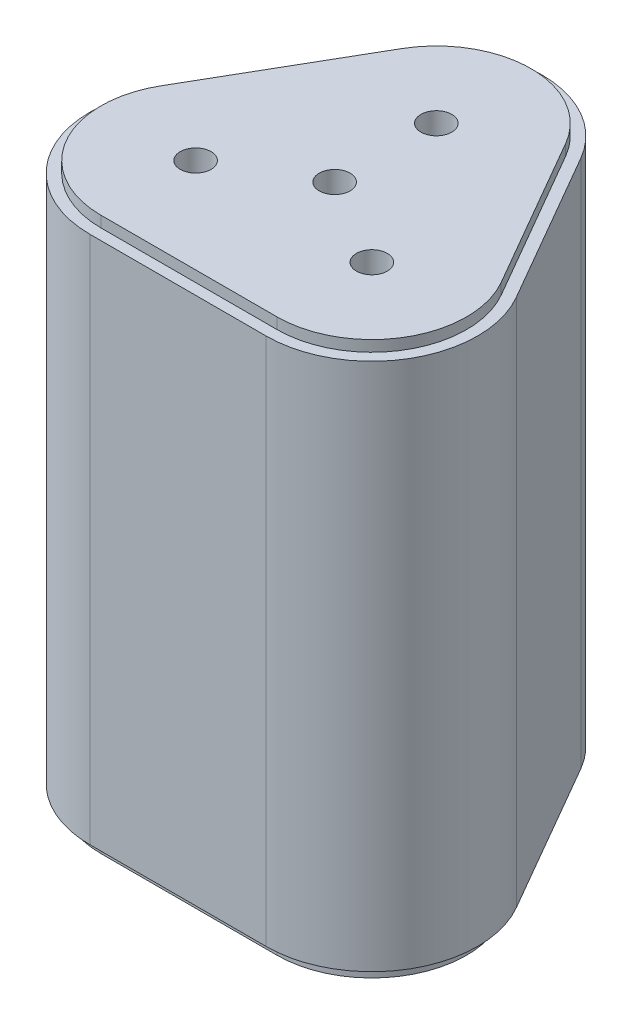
ISO-10303-21;
HEADER;
FILE_DESCRIPTION(('STEP AP214'),'2;1');
FILE_NAME('part.step','',(''),(''),'','','');
FILE_SCHEMA(('AUTOMOTIVE_DESIGN { 1 0 10303 214 1 1 1 1 }'));
ENDSEC;
DATA;
#1=APPLICATION_CONTEXT('core data for automotive mechanical design processes');
#2=APPLICATION_PROTOCOL_DEFINITION('international standard','automotive_design',2000,#1);
#3=PRODUCT_CONTEXT('',#1,'mechanical');
#4=PRODUCT('Part','Part','',(#3));
#5=PRODUCT_RELATED_PRODUCT_CATEGORY('part','',(#4));
#6=PRODUCT_DEFINITION_FORMATION('','',#4);
#7=PRODUCT_DEFINITION_CONTEXT('part definition',#1,'design');
#8=PRODUCT_DEFINITION('design','',#6,#7);
#9=PRODUCT_DEFINITION_SHAPE('','',#8);
#10=(LENGTH_UNIT() NAMED_UNIT(*) SI_UNIT(.MILLI.,.METRE.));
#11=(NAMED_UNIT(*) PLANE_ANGLE_UNIT() SI_UNIT($,.RADIAN.));
#12=(NAMED_UNIT(*) SI_UNIT($,.STERADIAN.) SOLID_ANGLE_UNIT());
#13=UNCERTAINTY_MEASURE_WITH_UNIT(LENGTH_MEASURE(1.E-05),#10,'distance_accuracy_value','');
#14=(GEOMETRIC_REPRESENTATION_CONTEXT(3) GLOBAL_UNCERTAINTY_ASSIGNED_CONTEXT((#13)) GLOBAL_UNIT_ASSIGNED_CONTEXT((#10,
#11,#12)) REPRESENTATION_CONTEXT('',''));
#15=CARTESIAN_POINT('',(0.,0.,0.));
#16=DIRECTION('',(0.,0.,1.));
#17=DIRECTION('',(1.,0.,0.));
#18=AXIS2_PLACEMENT_3D('',#15,#16,#17);
#19=CARTESIAN_POINT('',(0.,60.,-11.5470053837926));
#20=DIRECTION('',(0.,-1.,0.));
#21=DIRECTION('',(0.,0.,-1.));
#22=AXIS2_PLACEMENT_3D('',#19,#20,#21);
#23=PLANE('',#22);
#24=CARTESIAN_POINT('',(0.,60.,-11.5470053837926));
#25=DIRECTION('',(0.,1.,0.));
#26=DIRECTION('',(0.,0.,-1.));
#27=AXIS2_PLACEMENT_3D('',#24,#25,#26);
#28=CIRCLE('',#27,12.);
#29=CARTESIAN_POINT('',(10.3923048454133,60.,-17.5470053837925));
#30=VERTEX_POINT('',#29);
#31=CARTESIAN_POINT('',(-10.3923048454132,60.,-17.5470053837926));
#32=VERTEX_POINT('',#31);
#33=EDGE_CURVE('E310',#30,#32,#28,.T.);
#34=ORIENTED_EDGE('',*,*,#33,.T.);
#35=DIRECTION('',(-0.500000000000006,0.,0.866025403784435));
#36=VECTOR('',#35,1.);
#37=CARTESIAN_POINT('',(-10.3923048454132,60.,-17.5470053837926));
#38=LINE('',#37,#36);
#39=CARTESIAN_POINT('',(-20.3923048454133,60.,-0.226497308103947));
#40=VERTEX_POINT('',#39);
#41=EDGE_CURVE('E313',#32,#40,#38,.T.);
#42=ORIENTED_EDGE('',*,*,#41,.T.);
#43=CARTESIAN_POINT('',(-10.0000000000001,60.,5.77350269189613));
#44=DIRECTION('',(0.,1.,0.));
#45=DIRECTION('',(0.,0.,1.));
#46=AXIS2_PLACEMENT_3D('',#43,#44,#45);
#47=CIRCLE('',#46,12.);
#48=CARTESIAN_POINT('',(-10.0000000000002,60.,17.7735026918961));
#49=VERTEX_POINT('',#48);
#50=EDGE_CURVE('E316',#40,#49,#47,.T.);
#51=ORIENTED_EDGE('',*,*,#50,.T.);
#52=DIRECTION('',(1.,0.,0.));
#53=VECTOR('',#52,1.);
#54=CARTESIAN_POINT('',(9.99999999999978,60.,17.7735026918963));
#55=LINE('',#54,#53);
#56=CARTESIAN_POINT('',(9.99999999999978,60.,17.7735026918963));
#57=VERTEX_POINT('',#56);
#58=EDGE_CURVE('E318',#49,#57,#55,.T.);
#59=ORIENTED_EDGE('',*,*,#58,.T.);
#60=CARTESIAN_POINT('',(9.99999999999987,60.,5.77350269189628));
#61=DIRECTION('',(0.,1.,0.));
#62=DIRECTION('',(0.,0.,-1.));
#63=AXIS2_PLACEMENT_3D('',#60,#61,#62);
#64=CIRCLE('',#63,12.);
#65=CARTESIAN_POINT('',(20.3923048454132,60.,-0.226497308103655));
#66=VERTEX_POINT('',#65);
#67=EDGE_CURVE('E320',#57,#66,#64,.T.);
#68=ORIENTED_EDGE('',*,*,#67,.T.);
#69=DIRECTION('',(-0.499999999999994,0.,-0.866025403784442));
#70=VECTOR('',#69,1.);
#71=CARTESIAN_POINT('',(10.3923048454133,60.,-17.5470053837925));
#72=LINE('',#71,#70);
#73=EDGE_CURVE('E322',#66,#30,#72,.T.);
#74=ORIENTED_EDGE('',*,*,#73,.T.);
#75=EDGE_LOOP('',(#34,#42,#51,#59,#68,#74));
#76=FACE_BOUND('',#75,.T.);
#77=CARTESIAN_POINT('',(0.,60.,-11.5470053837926));
#78=DIRECTION('',(0.,1.,0.));
#79=DIRECTION('',(0.,0.,1.));
#80=AXIS2_PLACEMENT_3D('',#77,#78,#79);
#81=CIRCLE('',#80,10.75);
#82=CARTESIAN_POINT('',(9.30977309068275,60.,-16.9220053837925));
#83=VERTEX_POINT('',#82);
#84=CARTESIAN_POINT('',(-9.30977309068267,60.,-16.9220053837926));
#85=VERTEX_POINT('',#84);
#86=EDGE_CURVE('E218',#83,#85,#81,.T.);
#87=ORIENTED_EDGE('',*,*,#86,.F.);
#88=DIRECTION('',(-0.499999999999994,0.,-0.866025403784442));
#89=VECTOR('',#88,1.);
#90=CARTESIAN_POINT('',(19.3097730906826,60.,0.398502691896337));
#91=LINE('',#90,#89);
#92=CARTESIAN_POINT('',(19.3097730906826,60.,0.39850269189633));
#93=VERTEX_POINT('',#92);
#94=EDGE_CURVE('E215',#93,#83,#91,.T.);
#95=ORIENTED_EDGE('',*,*,#94,.F.);
#96=CARTESIAN_POINT('',(9.99999999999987,60.,5.77350269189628));
#97=DIRECTION('',(0.,1.,0.));
#98=DIRECTION('',(0.,0.,1.));
#99=AXIS2_PLACEMENT_3D('',#96,#97,#98);
#100=CIRCLE('',#99,10.75);
#101=CARTESIAN_POINT('',(9.99999999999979,60.,16.5235026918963));
#102=VERTEX_POINT('',#101);
#103=EDGE_CURVE('E528',#102,#93,#100,.T.);
#104=ORIENTED_EDGE('',*,*,#103,.F.);
#105=DIRECTION('',(1.,0.,0.));
#106=VECTOR('',#105,1.);
#107=CARTESIAN_POINT('',(-10.0000000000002,60.,16.5235026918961));
#108=LINE('',#107,#106);
#109=CARTESIAN_POINT('',(-10.0000000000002,60.,16.5235026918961));
#110=VERTEX_POINT('',#109);
#111=EDGE_CURVE('E525',#110,#102,#108,.T.);
#112=ORIENTED_EDGE('',*,*,#111,.F.);
#113=CARTESIAN_POINT('',(-10.0000000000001,60.,5.77350269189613));
#114=DIRECTION('',(0.,1.,0.));
#115=DIRECTION('',(0.,0.,1.));
#116=AXIS2_PLACEMENT_3D('',#113,#114,#115);
#117=CIRCLE('',#116,10.75);
#118=CARTESIAN_POINT('',(-19.3097730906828,60.,0.398502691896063));
#119=VERTEX_POINT('',#118);
#120=EDGE_CURVE('E57',#119,#110,#117,.T.);
#121=ORIENTED_EDGE('',*,*,#120,.F.);
#122=DIRECTION('',(-0.500000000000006,0.,0.866025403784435));
#123=VECTOR('',#122,1.);
#124=CARTESIAN_POINT('',(-9.30977309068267,60.,-16.9220053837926));
#125=LINE('',#124,#123);
#126=EDGE_CURVE('E52',#85,#119,#125,.T.);
#127=ORIENTED_EDGE('',*,*,#126,.F.);
#128=EDGE_LOOP('',(#87,#95,#104,#112,#121,#127));
#129=FACE_BOUND('',#128,.T.);
#130=ADVANCED_FACE('F37',(#76,#129),#23,.F.);
#131=CARTESIAN_POINT('',(0.,0.,-11.5470053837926));
#132=DIRECTION('',(0.,-1.,0.));
#133=DIRECTION('',(0.,0.,-1.));
#134=AXIS2_PLACEMENT_3D('',#131,#132,#133);
#135=PLANE('',#134);
#136=CARTESIAN_POINT('',(0.,0.,-11.5470053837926));
#137=DIRECTION('',(0.,1.,0.));
#138=DIRECTION('',(0.,0.,-1.));
#139=AXIS2_PLACEMENT_3D('',#136,#137,#138);
#140=CIRCLE('',#139,12.);
#141=CARTESIAN_POINT('',(10.3923048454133,0.,-17.5470053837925));
#142=VERTEX_POINT('',#141);
#143=CARTESIAN_POINT('',(-10.3923048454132,0.,-17.5470053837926));
#144=VERTEX_POINT('',#143);
#145=EDGE_CURVE('E309',#142,#144,#140,.T.);
#146=ORIENTED_EDGE('',*,*,#145,.F.);
#147=DIRECTION('',(-0.499999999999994,0.,-0.866025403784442));
#148=VECTOR('',#147,1.);
#149=CARTESIAN_POINT('',(10.3923048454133,0.,-17.5470053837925));
#150=LINE('',#149,#148);
#151=CARTESIAN_POINT('',(20.3923048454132,0.,-0.226497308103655));
#152=VERTEX_POINT('',#151);
#153=EDGE_CURVE('E314',#152,#142,#150,.T.);
#154=ORIENTED_EDGE('',*,*,#153,.F.);
#155=CARTESIAN_POINT('',(9.99999999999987,0.,5.77350269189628));
#156=DIRECTION('',(0.,1.,0.));
#157=DIRECTION('',(0.,0.,-1.));
#158=AXIS2_PLACEMENT_3D('',#155,#156,#157);
#159=CIRCLE('',#158,12.);
#160=CARTESIAN_POINT('',(9.99999999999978,0.,17.7735026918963));
#161=VERTEX_POINT('',#160);
#162=EDGE_CURVE('E333',#161,#152,#159,.T.);
#163=ORIENTED_EDGE('',*,*,#162,.F.);
#164=DIRECTION('',(1.,0.,0.));
#165=VECTOR('',#164,1.);
#166=CARTESIAN_POINT('',(9.99999999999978,0.,17.7735026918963));
#167=LINE('',#166,#165);
#168=CARTESIAN_POINT('',(-10.0000000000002,0.,17.7735026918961));
#169=VERTEX_POINT('',#168);
#170=EDGE_CURVE('E331',#169,#161,#167,.T.);
#171=ORIENTED_EDGE('',*,*,#170,.F.);
#172=CARTESIAN_POINT('',(-10.0000000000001,0.,5.77350269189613));
#173=DIRECTION('',(0.,1.,0.));
#174=DIRECTION('',(0.,0.,1.));
#175=AXIS2_PLACEMENT_3D('',#172,#173,#174);
#176=CIRCLE('',#175,12.);
#177=CARTESIAN_POINT('',(-20.3923048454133,0.,-0.226497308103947));
#178=VERTEX_POINT('',#177);
#179=EDGE_CURVE('E329',#178,#169,#176,.T.);
#180=ORIENTED_EDGE('',*,*,#179,.F.);
#181=DIRECTION('',(-0.500000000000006,0.,0.866025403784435));
#182=VECTOR('',#181,1.);
#183=CARTESIAN_POINT('',(-10.3923048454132,0.,-17.5470053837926));
#184=LINE('',#183,#182);
#185=EDGE_CURVE('E327',#144,#178,#184,.T.);
#186=ORIENTED_EDGE('',*,*,#185,.F.);
#187=EDGE_LOOP('',(#146,#154,#163,#171,#180,#186));
#188=FACE_BOUND('',#187,.T.);
#189=DIRECTION('',(0.499999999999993,0.,0.866025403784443));
#190=VECTOR('',#189,1.);
#191=CARTESIAN_POINT('',(9.30977309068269,0.,-16.9220053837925));
#192=LINE('',#191,#190);
#193=CARTESIAN_POINT('',(9.30977309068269,0.,-16.9220053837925));
#194=VERTEX_POINT('',#193);
#195=CARTESIAN_POINT('',(19.3097730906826,0.,0.398502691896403));
#196=VERTEX_POINT('',#195);
#197=EDGE_CURVE('E260',#194,#196,#192,.T.);
#198=ORIENTED_EDGE('',*,*,#197,.F.);
#199=CARTESIAN_POINT('',(0.,0.,-11.5470053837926));
#200=DIRECTION('',(0.,-1.,0.));
#201=DIRECTION('',(0.,0.,-1.));
#202=AXIS2_PLACEMENT_3D('',#199,#200,#201);
#203=CIRCLE('',#202,10.7499999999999);
#204=CARTESIAN_POINT('',(-9.30977309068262,0.,-16.9220053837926));
#205=VERTEX_POINT('',#204);
#206=EDGE_CURVE('E242',#205,#194,#203,.T.);
#207=ORIENTED_EDGE('',*,*,#206,.F.);
#208=DIRECTION('',(0.500000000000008,0.,-0.866025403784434));
#209=VECTOR('',#208,1.);
#210=CARTESIAN_POINT('',(-19.3097730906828,0.,0.398502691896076));
#211=LINE('',#210,#209);
#212=CARTESIAN_POINT('',(-19.3097730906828,0.,0.39850269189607));
#213=VERTEX_POINT('',#212);
#214=EDGE_CURVE('E247',#213,#205,#211,.T.);
#215=ORIENTED_EDGE('',*,*,#214,.F.);
#216=CARTESIAN_POINT('',(-10.0000000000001,0.,5.77350269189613));
#217=DIRECTION('',(0.,-1.,0.));
#218=DIRECTION('',(0.,0.,-1.));
#219=AXIS2_PLACEMENT_3D('',#216,#217,#218);
#220=CIRCLE('',#219,10.75);
#221=CARTESIAN_POINT('',(-10.0000000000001,0.,16.5235026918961));
#222=VERTEX_POINT('',#221);
#223=EDGE_CURVE('E266',#222,#213,#220,.T.);
#224=ORIENTED_EDGE('',*,*,#223,.F.);
#225=DIRECTION('',(-1.,0.,0.));
#226=VECTOR('',#225,1.);
#227=CARTESIAN_POINT('',(9.99999999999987,0.,16.5235026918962));
#228=LINE('',#227,#226);
#229=CARTESIAN_POINT('',(9.99999999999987,0.,16.5235026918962));
#230=VERTEX_POINT('',#229);
#231=EDGE_CURVE('E264',#230,#222,#228,.T.);
#232=ORIENTED_EDGE('',*,*,#231,.F.);
#233=CARTESIAN_POINT('',(9.99999999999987,0.,5.77350269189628));
#234=DIRECTION('',(0.,-1.,0.));
#235=DIRECTION('',(0.,0.,-1.));
#236=AXIS2_PLACEMENT_3D('',#233,#234,#235);
#237=CIRCLE('',#236,10.7499999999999);
#238=EDGE_CURVE('E262',#196,#230,#237,.T.);
#239=ORIENTED_EDGE('',*,*,#238,.F.);
#240=EDGE_LOOP('',(#198,#207,#215,#224,#232,#239));
#241=FACE_BOUND('',#240,.T.);
#242=ADVANCED_FACE('F357',(#188,#241),#135,.T.);
#243=CARTESIAN_POINT('',(0.,60.,-11.5470053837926));
#244=DIRECTION('',(0.,-1.,0.));
#245=DIRECTION('',(0.,0.,-1.));
#246=AXIS2_PLACEMENT_3D('',#243,#244,#245);
#247=CYLINDRICAL_SURFACE('',#246,12.);
#248=ORIENTED_EDGE('',*,*,#145,.T.);
#249=DIRECTION('',(0.,-1.,0.));
#250=VECTOR('',#249,1.);
#251=CARTESIAN_POINT('',(-10.3923048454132,60.,-17.5470053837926));
#252=LINE('',#251,#250);
#253=EDGE_CURVE('E12',#32,#144,#252,.T.);
#254=ORIENTED_EDGE('',*,*,#253,.F.);
#255=ORIENTED_EDGE('',*,*,#33,.F.);
#256=DIRECTION('',(0.,-1.,0.));
#257=VECTOR('',#256,1.);
#258=CARTESIAN_POINT('',(10.3923048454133,60.,-17.5470053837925));
#259=LINE('',#258,#257);
#260=EDGE_CURVE('E324',#30,#142,#259,.T.);
#261=ORIENTED_EDGE('',*,*,#260,.T.);
#262=EDGE_LOOP('',(#248,#254,#255,#261));
#263=FACE_BOUND('',#262,.T.);
#264=ADVANCED_FACE('F39',(#263),#247,.T.);
#265=CARTESIAN_POINT('',(-10.3923048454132,60.,-17.5470053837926));
#266=DIRECTION('',(0.866025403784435,0.,0.500000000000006));
#267=DIRECTION('',(0.500000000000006,0.,-0.866025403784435));
#268=AXIS2_PLACEMENT_3D('',#265,#266,#267);
#269=PLANE('',#268);
#270=ORIENTED_EDGE('',*,*,#185,.T.);
#271=DIRECTION('',(0.,-1.,0.));
#272=VECTOR('',#271,1.);
#273=CARTESIAN_POINT('',(-20.3923048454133,60.,-0.226497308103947));
#274=LINE('',#273,#272);
#275=EDGE_CURVE('E45',#40,#178,#274,.T.);
#276=ORIENTED_EDGE('',*,*,#275,.F.);
#277=ORIENTED_EDGE('',*,*,#41,.F.);
#278=ORIENTED_EDGE('',*,*,#253,.T.);
#279=EDGE_LOOP('',(#270,#276,#277,#278));
#280=FACE_BOUND('',#279,.T.);
#281=ADVANCED_FACE('F374',(#280),#269,.F.);
#282=CARTESIAN_POINT('',(-10.0000000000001,60.,5.77350269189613));
#283=DIRECTION('',(0.,-1.,0.));
#284=DIRECTION('',(0.,0.,-1.));
#285=AXIS2_PLACEMENT_3D('',#282,#283,#284);
#286=CYLINDRICAL_SURFACE('',#285,12.);
#287=ORIENTED_EDGE('',*,*,#179,.T.);
#288=DIRECTION('',(0.,-1.,0.));
#289=VECTOR('',#288,1.);
#290=CARTESIAN_POINT('',(-10.0000000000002,60.,17.7735026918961));
#291=LINE('',#290,#289);
#292=EDGE_CURVE('E344',#49,#169,#291,.T.);
#293=ORIENTED_EDGE('',*,*,#292,.F.);
#294=ORIENTED_EDGE('',*,*,#50,.F.);
#295=ORIENTED_EDGE('',*,*,#275,.T.);
#296=EDGE_LOOP('',(#287,#293,#294,#295));
#297=FACE_BOUND('',#296,.T.);
#298=ADVANCED_FACE('F351',(#297),#286,.T.);
#299=CARTESIAN_POINT('',(9.99999999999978,60.,17.7735026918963));
#300=DIRECTION('',(0.,0.,-1.));
#301=DIRECTION('',(-1.,0.,0.));
#302=AXIS2_PLACEMENT_3D('',#299,#300,#301);
#303=PLANE('',#302);
#304=ORIENTED_EDGE('',*,*,#170,.T.);
#305=DIRECTION('',(0.,-1.,0.));
#306=VECTOR('',#305,1.);
#307=CARTESIAN_POINT('',(9.99999999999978,60.,17.7735026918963));
#308=LINE('',#307,#306);
#309=EDGE_CURVE('E341',#57,#161,#308,.T.);
#310=ORIENTED_EDGE('',*,*,#309,.F.);
#311=ORIENTED_EDGE('',*,*,#58,.F.);
#312=ORIENTED_EDGE('',*,*,#292,.T.);
#313=EDGE_LOOP('',(#304,#310,#311,#312));
#314=FACE_BOUND('',#313,.T.);
#315=ADVANCED_FACE('F363',(#314),#303,.F.);
#316=CARTESIAN_POINT('',(9.99999999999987,60.,5.77350269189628));
#317=DIRECTION('',(0.,-1.,0.));
#318=DIRECTION('',(0.,0.,-1.));
#319=AXIS2_PLACEMENT_3D('',#316,#317,#318);
#320=CYLINDRICAL_SURFACE('',#319,12.);
#321=ORIENTED_EDGE('',*,*,#162,.T.);
#322=DIRECTION('',(0.,-1.,0.));
#323=VECTOR('',#322,1.);
#324=CARTESIAN_POINT('',(20.3923048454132,60.,-0.226497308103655));
#325=LINE('',#324,#323);
#326=EDGE_CURVE('E338',#66,#152,#325,.T.);
#327=ORIENTED_EDGE('',*,*,#326,.F.);
#328=ORIENTED_EDGE('',*,*,#67,.F.);
#329=ORIENTED_EDGE('',*,*,#309,.T.);
#330=EDGE_LOOP('',(#321,#327,#328,#329));
#331=FACE_BOUND('',#330,.T.);
#332=ADVANCED_FACE('F367',(#331),#320,.T.);
#333=CARTESIAN_POINT('',(10.3923048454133,60.,-17.5470053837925));
#334=DIRECTION('',(-0.866025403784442,0.,0.499999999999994));
#335=DIRECTION('',(0.499999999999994,0.,0.866025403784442));
#336=AXIS2_PLACEMENT_3D('',#333,#334,#335);
#337=PLANE('',#336);
#338=ORIENTED_EDGE('',*,*,#153,.T.);
#339=ORIENTED_EDGE('',*,*,#260,.F.);
#340=ORIENTED_EDGE('',*,*,#73,.F.);
#341=ORIENTED_EDGE('',*,*,#326,.T.);
#342=EDGE_LOOP('',(#338,#339,#340,#341));
#343=FACE_BOUND('',#342,.T.);
#344=ADVANCED_FACE('F377',(#343),#337,.F.);
#345=CARTESIAN_POINT('',(0.,-1.5,-11.5470053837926));
#346=DIRECTION('',(0.,-1.,0.));
#347=DIRECTION('',(0.,0.,-1.));
#348=AXIS2_PLACEMENT_3D('',#345,#346,#347);
#349=PLANE('',#348);
#350=CARTESIAN_POINT('',(0.,-1.5,-11.5470053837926));
#351=DIRECTION('',(0.,-1.,0.));
#352=DIRECTION('',(0.,0.,-1.));
#353=AXIS2_PLACEMENT_3D('',#350,#351,#352);
#354=CIRCLE('',#353,10.7499999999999);
#355=CARTESIAN_POINT('',(-9.30977309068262,-1.5,-16.9220053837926));
#356=VERTEX_POINT('',#355);
#357=CARTESIAN_POINT('',(9.30977309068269,-1.5,-16.9220053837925));
#358=VERTEX_POINT('',#357);
#359=EDGE_CURVE('E243',#356,#358,#354,.T.);
#360=ORIENTED_EDGE('',*,*,#359,.T.);
#361=DIRECTION('',(0.499999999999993,0.,0.866025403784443));
#362=VECTOR('',#361,1.);
#363=CARTESIAN_POINT('',(9.30977309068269,-1.5,-16.9220053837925));
#364=LINE('',#363,#362);
#365=CARTESIAN_POINT('',(19.3097730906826,-1.5,0.398502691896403));
#366=VERTEX_POINT('',#365);
#367=EDGE_CURVE('E246',#358,#366,#364,.T.);
#368=ORIENTED_EDGE('',*,*,#367,.T.);
#369=CARTESIAN_POINT('',(9.99999999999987,-1.5,5.77350269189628));
#370=DIRECTION('',(0.,-1.,0.));
#371=DIRECTION('',(0.,0.,-1.));
#372=AXIS2_PLACEMENT_3D('',#369,#370,#371);
#373=CIRCLE('',#372,10.7499999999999);
#374=CARTESIAN_POINT('',(9.99999999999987,-1.5,16.5235026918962));
#375=VERTEX_POINT('',#374);
#376=EDGE_CURVE('E249',#366,#375,#373,.T.);
#377=ORIENTED_EDGE('',*,*,#376,.T.);
#378=DIRECTION('',(-1.,0.,0.));
#379=VECTOR('',#378,1.);
#380=CARTESIAN_POINT('',(9.99999999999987,-1.5,16.5235026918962));
#381=LINE('',#380,#379);
#382=CARTESIAN_POINT('',(-10.0000000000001,-1.5,16.5235026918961));
#383=VERTEX_POINT('',#382);
#384=EDGE_CURVE('E251',#375,#383,#381,.T.);
#385=ORIENTED_EDGE('',*,*,#384,.T.);
#386=CARTESIAN_POINT('',(-10.0000000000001,-1.5,5.77350269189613));
#387=DIRECTION('',(0.,-1.,0.));
#388=DIRECTION('',(0.,0.,-1.));
#389=AXIS2_PLACEMENT_3D('',#386,#387,#388);
#390=CIRCLE('',#389,10.75);
#391=CARTESIAN_POINT('',(-19.3097730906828,-1.5,0.39850269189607));
#392=VERTEX_POINT('',#391);
#393=EDGE_CURVE('E253',#383,#392,#390,.T.);
#394=ORIENTED_EDGE('',*,*,#393,.T.);
#395=DIRECTION('',(0.500000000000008,0.,-0.866025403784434));
#396=VECTOR('',#395,1.);
#397=CARTESIAN_POINT('',(-19.3097730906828,-1.5,0.398502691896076));
#398=LINE('',#397,#396);
#399=EDGE_CURVE('E255',#392,#356,#398,.T.);
#400=ORIENTED_EDGE('',*,*,#399,.T.);
#401=EDGE_LOOP('',(#360,#368,#377,#385,#394,#400));
#402=FACE_BOUND('',#401,.T.);
#403=DIRECTION('',(0.500000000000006,0.,-0.866025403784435));
#404=VECTOR('',#403,1.);
#405=CARTESIAN_POINT('',(-18.2272413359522,-1.5,1.0235026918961));
#406=LINE('',#405,#404);
#407=CARTESIAN_POINT('',(-18.2272413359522,-1.5,1.0235026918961));
#408=VERTEX_POINT('',#407);
#409=CARTESIAN_POINT('',(-8.22724133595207,-1.5,-16.2970053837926));
#410=VERTEX_POINT('',#409);
#411=EDGE_CURVE('E222',#408,#410,#406,.T.);
#412=ORIENTED_EDGE('',*,*,#411,.F.);
#413=CARTESIAN_POINT('',(-10.0000000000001,-1.5,5.77350269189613));
#414=DIRECTION('',(0.,-1.,0.));
#415=DIRECTION('',(0.,0.,-1.));
#416=AXIS2_PLACEMENT_3D('',#413,#414,#415);
#417=CIRCLE('',#416,9.49999999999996);
#418=CARTESIAN_POINT('',(-10.0000000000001,-1.5,15.2735026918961));
#419=VERTEX_POINT('',#418);
#420=EDGE_CURVE('E219',#419,#408,#417,.T.);
#421=ORIENTED_EDGE('',*,*,#420,.F.);
#422=DIRECTION('',(-1.,0.,0.));
#423=VECTOR('',#422,1.);
#424=CARTESIAN_POINT('',(9.99999999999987,-1.5,15.2735026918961));
#425=LINE('',#424,#423);
#426=CARTESIAN_POINT('',(9.99999999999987,-1.5,15.2735026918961));
#427=VERTEX_POINT('',#426);
#428=EDGE_CURVE('E239',#427,#419,#425,.T.);
#429=ORIENTED_EDGE('',*,*,#428,.F.);
#430=CARTESIAN_POINT('',(9.99999999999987,-1.5,5.77350269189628));
#431=DIRECTION('',(0.,-1.,0.));
#432=DIRECTION('',(0.,0.,-1.));
#433=AXIS2_PLACEMENT_3D('',#430,#431,#432);
#434=CIRCLE('',#433,9.49999999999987);
#435=CARTESIAN_POINT('',(18.227241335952,-1.5,1.02350269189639));
#436=VERTEX_POINT('',#435);
#437=EDGE_CURVE('E236',#436,#427,#434,.T.);
#438=ORIENTED_EDGE('',*,*,#437,.F.);
#439=DIRECTION('',(0.499999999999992,0.,0.866025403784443));
#440=VECTOR('',#439,1.);
#441=CARTESIAN_POINT('',(8.22724133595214,-1.5,-16.2970053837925));
#442=LINE('',#441,#440);
#443=CARTESIAN_POINT('',(8.22724133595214,-1.5,-16.2970053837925));
#444=VERTEX_POINT('',#443);
#445=EDGE_CURVE('E233',#444,#436,#442,.T.);
#446=ORIENTED_EDGE('',*,*,#445,.F.);
#447=CARTESIAN_POINT('',(0.,-1.5,-11.5470053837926));
#448=DIRECTION('',(0.,-1.,0.));
#449=DIRECTION('',(0.,0.,-1.));
#450=AXIS2_PLACEMENT_3D('',#447,#448,#449);
#451=CIRCLE('',#450,9.49999999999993);
#452=EDGE_CURVE('E230',#410,#444,#451,.T.);
#453=ORIENTED_EDGE('',*,*,#452,.F.);
#454=EDGE_LOOP('',(#412,#421,#429,#438,#446,#453));
#455=FACE_BOUND('',#454,.T.);
#456=ADVANCED_FACE('F379',(#402,#455),#349,.T.);
#457=CARTESIAN_POINT('',(0.,-1.5,-11.5470053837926));
#458=DIRECTION('',(0.,1.,0.));
#459=DIRECTION('',(0.,0.,1.));
#460=AXIS2_PLACEMENT_3D('',#457,#458,#459);
#461=CYLINDRICAL_SURFACE('',#460,10.7499999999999);
#462=ORIENTED_EDGE('',*,*,#206,.T.);
#463=DIRECTION('',(0.,1.,0.));
#464=VECTOR('',#463,1.);
#465=CARTESIAN_POINT('',(9.30977309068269,-1.5,-16.9220053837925));
#466=LINE('',#465,#464);
#467=EDGE_CURVE('E283',#358,#194,#466,.T.);
#468=ORIENTED_EDGE('',*,*,#467,.F.);
#469=ORIENTED_EDGE('',*,*,#359,.F.);
#470=DIRECTION('',(0.,1.,0.));
#471=VECTOR('',#470,1.);
#472=CARTESIAN_POINT('',(-9.30977309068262,-1.5,-16.9220053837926));
#473=LINE('',#472,#471);
#474=EDGE_CURVE('E257',#356,#205,#473,.T.);
#475=ORIENTED_EDGE('',*,*,#474,.T.);
#476=EDGE_LOOP('',(#462,#468,#469,#475));
#477=FACE_BOUND('',#476,.T.);
#478=ADVANCED_FACE('F385',(#477),#461,.T.);
#479=CARTESIAN_POINT('',(9.30977309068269,-1.5,-16.9220053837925));
#480=DIRECTION('',(-0.866025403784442,0.,0.499999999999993));
#481=DIRECTION('',(0.499999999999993,0.,0.866025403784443));
#482=AXIS2_PLACEMENT_3D('',#479,#480,#481);
#483=PLANE('',#482);
#484=ORIENTED_EDGE('',*,*,#197,.T.);
#485=DIRECTION('',(0.,1.,0.));
#486=VECTOR('',#485,1.);
#487=CARTESIAN_POINT('',(19.3097730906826,-1.5,0.398502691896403));
#488=LINE('',#487,#486);
#489=EDGE_CURVE('E280',#366,#196,#488,.T.);
#490=ORIENTED_EDGE('',*,*,#489,.F.);
#491=ORIENTED_EDGE('',*,*,#367,.F.);
#492=ORIENTED_EDGE('',*,*,#467,.T.);
#493=EDGE_LOOP('',(#484,#490,#491,#492));
#494=FACE_BOUND('',#493,.T.);
#495=ADVANCED_FACE('F427',(#494),#483,.F.);
#496=CARTESIAN_POINT('',(9.99999999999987,-1.5,5.77350269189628));
#497=DIRECTION('',(0.,1.,0.));
#498=DIRECTION('',(0.,0.,1.));
#499=AXIS2_PLACEMENT_3D('',#496,#497,#498);
#500=CYLINDRICAL_SURFACE('',#499,10.7499999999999);
#501=ORIENTED_EDGE('',*,*,#238,.T.);
#502=DIRECTION('',(0.,1.,0.));
#503=VECTOR('',#502,1.);
#504=CARTESIAN_POINT('',(9.99999999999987,-1.5,16.5235026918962));
#505=LINE('',#504,#503);
#506=EDGE_CURVE('E277',#375,#230,#505,.T.);
#507=ORIENTED_EDGE('',*,*,#506,.F.);
#508=ORIENTED_EDGE('',*,*,#376,.F.);
#509=ORIENTED_EDGE('',*,*,#489,.T.);
#510=EDGE_LOOP('',(#501,#507,#508,#509));
#511=FACE_BOUND('',#510,.T.);
#512=ADVANCED_FACE('F431',(#511),#500,.T.);
#513=CARTESIAN_POINT('',(9.99999999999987,-1.5,16.5235026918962));
#514=DIRECTION('',(0.,0.,-1.));
#515=DIRECTION('',(-1.,0.,0.));
#516=AXIS2_PLACEMENT_3D('',#513,#514,#515);
#517=PLANE('',#516);
#518=ORIENTED_EDGE('',*,*,#231,.T.);
#519=DIRECTION('',(0.,1.,0.));
#520=VECTOR('',#519,1.);
#521=CARTESIAN_POINT('',(-10.0000000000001,-1.5,16.5235026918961));
#522=LINE('',#521,#520);
#523=EDGE_CURVE('E274',#383,#222,#522,.T.);
#524=ORIENTED_EDGE('',*,*,#523,.F.);
#525=ORIENTED_EDGE('',*,*,#384,.F.);
#526=ORIENTED_EDGE('',*,*,#506,.T.);
#527=EDGE_LOOP('',(#518,#524,#525,#526));
#528=FACE_BOUND('',#527,.T.);
#529=ADVANCED_FACE('F435',(#528),#517,.F.);
#530=CARTESIAN_POINT('',(-10.0000000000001,-1.5,5.77350269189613));
#531=DIRECTION('',(0.,1.,0.));
#532=DIRECTION('',(0.,0.,1.));
#533=AXIS2_PLACEMENT_3D('',#530,#531,#532);
#534=CYLINDRICAL_SURFACE('',#533,10.75);
#535=ORIENTED_EDGE('',*,*,#223,.T.);
#536=DIRECTION('',(0.,1.,0.));
#537=VECTOR('',#536,1.);
#538=CARTESIAN_POINT('',(-19.3097730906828,-1.5,0.39850269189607));
#539=LINE('',#538,#537);
#540=EDGE_CURVE('E272',#392,#213,#539,.T.);
#541=ORIENTED_EDGE('',*,*,#540,.F.);
#542=ORIENTED_EDGE('',*,*,#393,.F.);
#543=ORIENTED_EDGE('',*,*,#523,.T.);
#544=EDGE_LOOP('',(#535,#541,#542,#543));
#545=FACE_BOUND('',#544,.T.);
#546=ADVANCED_FACE('F439',(#545),#534,.T.);
#547=CARTESIAN_POINT('',(-19.3097730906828,-1.5,0.398502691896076));
#548=DIRECTION('',(0.866025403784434,0.,0.500000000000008));
#549=DIRECTION('',(0.500000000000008,0.,-0.866025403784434));
#550=AXIS2_PLACEMENT_3D('',#547,#548,#549);
#551=PLANE('',#550);
#552=ORIENTED_EDGE('',*,*,#214,.T.);
#553=ORIENTED_EDGE('',*,*,#474,.F.);
#554=ORIENTED_EDGE('',*,*,#399,.F.);
#555=ORIENTED_EDGE('',*,*,#540,.T.);
#556=EDGE_LOOP('',(#552,#553,#554,#555));
#557=FACE_BOUND('',#556,.T.);
#558=ADVANCED_FACE('F423',(#557),#551,.F.);
#559=CARTESIAN_POINT('',(0.,57.,-11.5470053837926));
#560=DIRECTION('',(0.,-1.,0.));
#561=DIRECTION('',(0.,0.,-1.));
#562=AXIS2_PLACEMENT_3D('',#559,#560,#561);
#563=PLANE('',#562);
#564=CARTESIAN_POINT('',(0.,57.,-11.5470053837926));
#565=DIRECTION('',(0.,-1.,0.));
#566=DIRECTION('',(0.,0.,-1.));
#567=AXIS2_PLACEMENT_3D('',#564,#565,#566);
#568=CIRCLE('',#567,1.75);
#569=CARTESIAN_POINT('',(0.,57.,-13.2970053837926));
#570=VERTEX_POINT('',#569);
#571=EDGE_CURVE('E493',#570,#570,#568,.T.);
#572=ORIENTED_EDGE('',*,*,#571,.F.);
#573=EDGE_LOOP('',(#572));
#574=FACE_BOUND('',#573,.T.);
#575=CARTESIAN_POINT('',(-10.0000000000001,57.,5.77350269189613));
#576=DIRECTION('',(0.,-1.,0.));
#577=DIRECTION('',(0.,0.,-1.));
#578=AXIS2_PLACEMENT_3D('',#575,#576,#577);
#579=CIRCLE('',#578,1.75);
#580=CARTESIAN_POINT('',(-10.0000000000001,57.,4.02350269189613));
#581=VERTEX_POINT('',#580);
#582=EDGE_CURVE('E495',#581,#581,#579,.T.);
#583=ORIENTED_EDGE('',*,*,#582,.F.);
#584=EDGE_LOOP('',(#583));
#585=FACE_BOUND('',#584,.T.);
#586=CARTESIAN_POINT('',(9.99999999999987,57.,5.77350269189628));
#587=DIRECTION('',(0.,-1.,0.));
#588=DIRECTION('',(0.,0.,-1.));
#589=AXIS2_PLACEMENT_3D('',#586,#587,#588);
#590=CIRCLE('',#589,1.75);
#591=CARTESIAN_POINT('',(9.99999999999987,57.,4.02350269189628));
#592=VERTEX_POINT('',#591);
#593=EDGE_CURVE('E501',#592,#592,#590,.T.);
#594=ORIENTED_EDGE('',*,*,#593,.F.);
#595=EDGE_LOOP('',(#594));
#596=FACE_BOUND('',#595,.T.);
#597=CARTESIAN_POINT('',(0.,57.,0.));
#598=DIRECTION('',(0.,-1.,0.));
#599=DIRECTION('',(0.,0.,-1.));
#600=AXIS2_PLACEMENT_3D('',#597,#598,#599);
#601=CIRCLE('',#600,1.75);
#602=CARTESIAN_POINT('',(0.,57.,-1.75));
#603=VERTEX_POINT('',#602);
#604=EDGE_CURVE('E507',#603,#603,#601,.T.);
#605=ORIENTED_EDGE('',*,*,#604,.F.);
#606=EDGE_LOOP('',(#605));
#607=FACE_BOUND('',#606,.T.);
#608=CARTESIAN_POINT('',(-10.0000000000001,57.,5.77350269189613));
#609=DIRECTION('',(0.,-1.,0.));
#610=DIRECTION('',(0.,0.,-1.));
#611=AXIS2_PLACEMENT_3D('',#608,#609,#610);
#612=CIRCLE('',#611,9.49999999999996);
#613=CARTESIAN_POINT('',(-18.2272413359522,57.,1.0235026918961));
#614=VERTEX_POINT('',#613);
#615=CARTESIAN_POINT('',(-10.0000000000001,57.,15.2735026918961));
#616=VERTEX_POINT('',#615);
#617=EDGE_CURVE('E295',#614,#616,#612,.F.);
#618=ORIENTED_EDGE('',*,*,#617,.F.);
#619=DIRECTION('',(-0.500000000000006,0.,0.866025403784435));
#620=VECTOR('',#619,1.);
#621=CARTESIAN_POINT('',(-18.2272413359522,57.,1.0235026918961));
#622=LINE('',#621,#620);
#623=CARTESIAN_POINT('',(-8.22724133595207,57.,-16.2970053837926));
#624=VERTEX_POINT('',#623);
#625=EDGE_CURVE('E297',#624,#614,#622,.T.);
#626=ORIENTED_EDGE('',*,*,#625,.F.);
#627=CARTESIAN_POINT('',(0.,57.,-11.5470053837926));
#628=DIRECTION('',(0.,-1.,0.));
#629=DIRECTION('',(0.,0.,-1.));
#630=AXIS2_PLACEMENT_3D('',#627,#628,#629);
#631=CIRCLE('',#630,9.49999999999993);
#632=CARTESIAN_POINT('',(8.22724133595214,57.,-16.2970053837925));
#633=VERTEX_POINT('',#632);
#634=EDGE_CURVE('E286',#633,#624,#631,.F.);
#635=ORIENTED_EDGE('',*,*,#634,.F.);
#636=DIRECTION('',(-0.499999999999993,0.,-0.866025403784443));
#637=VECTOR('',#636,1.);
#638=CARTESIAN_POINT('',(18.227241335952,57.,1.02350269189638));
#639=LINE('',#638,#637);
#640=CARTESIAN_POINT('',(18.227241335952,57.,1.02350269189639));
#641=VERTEX_POINT('',#640);
#642=EDGE_CURVE('E288',#641,#633,#639,.T.);
#643=ORIENTED_EDGE('',*,*,#642,.F.);
#644=CARTESIAN_POINT('',(9.99999999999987,57.,5.77350269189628));
#645=DIRECTION('',(0.,-1.,0.));
#646=DIRECTION('',(0.,0.,-1.));
#647=AXIS2_PLACEMENT_3D('',#644,#645,#646);
#648=CIRCLE('',#647,9.49999999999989);
#649=CARTESIAN_POINT('',(9.99999999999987,57.,15.2735026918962));
#650=VERTEX_POINT('',#649);
#651=EDGE_CURVE('E291',#650,#641,#648,.F.);
#652=ORIENTED_EDGE('',*,*,#651,.F.);
#653=DIRECTION('',(1.,0.,0.));
#654=VECTOR('',#653,1.);
#655=CARTESIAN_POINT('',(-10.0000000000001,57.,15.2735026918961));
#656=LINE('',#655,#654);
#657=EDGE_CURVE('E293',#616,#650,#656,.T.);
#658=ORIENTED_EDGE('',*,*,#657,.F.);
#659=EDGE_LOOP('',(#618,#626,#635,#643,#652,#658));
#660=FACE_BOUND('',#659,.T.);
#661=ADVANCED_FACE('F405',(#574,#585,#596,#607,#660),#563,.T.);
#662=CARTESIAN_POINT('',(-18.2272413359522,113.293332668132,1.0235026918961));
#663=DIRECTION('',(-0.866025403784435,0.,-0.500000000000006));
#664=DIRECTION('',(-0.500000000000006,0.,0.866025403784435));
#665=AXIS2_PLACEMENT_3D('',#662,#663,#664);
#666=PLANE('',#665);
#667=ORIENTED_EDGE('',*,*,#625,.T.);
#668=DIRECTION('',(0.,-1.,0.));
#669=VECTOR('',#668,1.);
#670=CARTESIAN_POINT('',(-18.2272413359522,113.293332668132,1.0235026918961));
#671=LINE('',#670,#669);
#672=EDGE_CURVE('E285',#614,#408,#671,.T.);
#673=ORIENTED_EDGE('',*,*,#672,.T.);
#674=ORIENTED_EDGE('',*,*,#411,.T.);
#675=DIRECTION('',(0.,-1.,0.));
#676=VECTOR('',#675,1.);
#677=CARTESIAN_POINT('',(-8.22724133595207,113.293332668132,-16.2970053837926));
#678=LINE('',#677,#676);
#679=EDGE_CURVE('E305',#624,#410,#678,.T.);
#680=ORIENTED_EDGE('',*,*,#679,.F.);
#681=EDGE_LOOP('',(#667,#673,#674,#680));
#682=FACE_BOUND('',#681,.T.);
#683=ADVANCED_FACE('F401',(#682),#666,.F.);
#684=CARTESIAN_POINT('',(0.,113.293332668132,-11.5470053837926));
#685=DIRECTION('',(0.,-1.,0.));
#686=DIRECTION('',(0.,0.,-1.));
#687=AXIS2_PLACEMENT_3D('',#684,#685,#686);
#688=CYLINDRICAL_SURFACE('',#687,9.49999999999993);
#689=ORIENTED_EDGE('',*,*,#634,.T.);
#690=ORIENTED_EDGE('',*,*,#679,.T.);
#691=ORIENTED_EDGE('',*,*,#452,.T.);
#692=DIRECTION('',(0.,-1.,0.));
#693=VECTOR('',#692,1.);
#694=CARTESIAN_POINT('',(8.22724133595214,113.293332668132,-16.2970053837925));
#695=LINE('',#694,#693);
#696=EDGE_CURVE('E303',#633,#444,#695,.T.);
#697=ORIENTED_EDGE('',*,*,#696,.F.);
#698=EDGE_LOOP('',(#689,#690,#691,#697));
#699=FACE_BOUND('',#698,.T.);
#700=ADVANCED_FACE('F404',(#699),#688,.F.);
#701=CARTESIAN_POINT('',(18.227241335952,113.293332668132,1.02350269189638));
#702=DIRECTION('',(0.866025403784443,0.,-0.499999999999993));
#703=DIRECTION('',(-0.499999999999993,0.,-0.866025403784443));
#704=AXIS2_PLACEMENT_3D('',#701,#702,#703);
#705=PLANE('',#704);
#706=ORIENTED_EDGE('',*,*,#642,.T.);
#707=ORIENTED_EDGE('',*,*,#696,.T.);
#708=ORIENTED_EDGE('',*,*,#445,.T.);
#709=DIRECTION('',(0.,-1.,0.));
#710=VECTOR('',#709,1.);
#711=CARTESIAN_POINT('',(18.227241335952,113.293332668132,1.02350269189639));
#712=LINE('',#711,#710);
#713=EDGE_CURVE('E301',#641,#436,#712,.T.);
#714=ORIENTED_EDGE('',*,*,#713,.F.);
#715=EDGE_LOOP('',(#706,#707,#708,#714));
#716=FACE_BOUND('',#715,.T.);
#717=ADVANCED_FACE('F409',(#716),#705,.F.);
#718=CARTESIAN_POINT('',(9.99999999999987,113.293332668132,5.77350269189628));
#719=DIRECTION('',(0.,-1.,0.));
#720=DIRECTION('',(0.,0.,-1.));
#721=AXIS2_PLACEMENT_3D('',#718,#719,#720);
#722=CYLINDRICAL_SURFACE('',#721,9.49999999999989);
#723=ORIENTED_EDGE('',*,*,#651,.T.);
#724=ORIENTED_EDGE('',*,*,#713,.T.);
#725=ORIENTED_EDGE('',*,*,#437,.T.);
#726=DIRECTION('',(0.,-1.,0.));
#727=VECTOR('',#726,1.);
#728=CARTESIAN_POINT('',(9.99999999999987,113.293332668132,15.2735026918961));
#729=LINE('',#728,#727);
#730=EDGE_CURVE('E299',#650,#427,#729,.T.);
#731=ORIENTED_EDGE('',*,*,#730,.F.);
#732=EDGE_LOOP('',(#723,#724,#725,#731));
#733=FACE_BOUND('',#732,.T.);
#734=ADVANCED_FACE('F413',(#733),#722,.F.);
#735=CARTESIAN_POINT('',(-10.0000000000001,113.293332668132,15.2735026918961));
#736=DIRECTION('',(0.,0.,1.));
#737=DIRECTION('',(1.,0.,0.));
#738=AXIS2_PLACEMENT_3D('',#735,#736,#737);
#739=PLANE('',#738);
#740=ORIENTED_EDGE('',*,*,#657,.T.);
#741=ORIENTED_EDGE('',*,*,#730,.T.);
#742=ORIENTED_EDGE('',*,*,#428,.T.);
#743=DIRECTION('',(0.,-1.,0.));
#744=VECTOR('',#743,1.);
#745=CARTESIAN_POINT('',(-10.0000000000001,113.293332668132,15.2735026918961));
#746=LINE('',#745,#744);
#747=EDGE_CURVE('E289',#616,#419,#746,.T.);
#748=ORIENTED_EDGE('',*,*,#747,.F.);
#749=EDGE_LOOP('',(#740,#741,#742,#748));
#750=FACE_BOUND('',#749,.T.);
#751=ADVANCED_FACE('F399',(#750),#739,.F.);
#752=CARTESIAN_POINT('',(-10.0000000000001,113.293332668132,5.77350269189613));
#753=DIRECTION('',(0.,-1.,0.));
#754=DIRECTION('',(0.,0.,-1.));
#755=AXIS2_PLACEMENT_3D('',#752,#753,#754);
#756=CYLINDRICAL_SURFACE('',#755,9.49999999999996);
#757=ORIENTED_EDGE('',*,*,#617,.T.);
#758=ORIENTED_EDGE('',*,*,#747,.T.);
#759=ORIENTED_EDGE('',*,*,#420,.T.);
#760=ORIENTED_EDGE('',*,*,#672,.F.);
#761=EDGE_LOOP('',(#757,#758,#759,#760));
#762=FACE_BOUND('',#761,.T.);
#763=ADVANCED_FACE('F396',(#762),#756,.F.);
#764=CARTESIAN_POINT('',(0.,61.25,-11.5470053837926));
#765=DIRECTION('',(0.,-1.,0.));
#766=DIRECTION('',(0.,0.,-1.));
#767=AXIS2_PLACEMENT_3D('',#764,#765,#766);
#768=CYLINDRICAL_SURFACE('',#767,10.75);
#769=ORIENTED_EDGE('',*,*,#86,.T.);
#770=DIRECTION('',(0.,-1.,0.));
#771=VECTOR('',#770,1.);
#772=CARTESIAN_POINT('',(-9.30977309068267,61.25,-16.9220053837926));
#773=LINE('',#772,#771);
#774=CARTESIAN_POINT('',(-9.30977309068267,61.25,-16.9220053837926));
#775=VERTEX_POINT('',#774);
#776=EDGE_CURVE('E199',#775,#85,#773,.T.);
#777=ORIENTED_EDGE('',*,*,#776,.F.);
#778=CARTESIAN_POINT('',(0.,61.25,-11.5470053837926));
#779=DIRECTION('',(0.,1.,0.));
#780=DIRECTION('',(0.,0.,1.));
#781=AXIS2_PLACEMENT_3D('',#778,#779,#780);
#782=CIRCLE('',#781,10.75);
#783=CARTESIAN_POINT('',(9.30977309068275,61.25,-16.9220053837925));
#784=VERTEX_POINT('',#783);
#785=EDGE_CURVE('E206',#784,#775,#782,.T.);
#786=ORIENTED_EDGE('',*,*,#785,.F.);
#787=DIRECTION('',(0.,-1.,0.));
#788=VECTOR('',#787,1.);
#789=CARTESIAN_POINT('',(9.30977309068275,61.25,-16.9220053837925));
#790=LINE('',#789,#788);
#791=EDGE_CURVE('E521',#784,#83,#790,.T.);
#792=ORIENTED_EDGE('',*,*,#791,.T.);
#793=EDGE_LOOP('',(#769,#777,#786,#792));
#794=FACE_BOUND('',#793,.T.);
#795=ADVANCED_FACE('F217',(#794),#768,.T.);
#796=CARTESIAN_POINT('',(-9.30977309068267,61.25,-16.9220053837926));
#797=DIRECTION('',(0.866025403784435,0.,0.500000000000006));
#798=DIRECTION('',(0.500000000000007,0.,-0.866025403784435));
#799=AXIS2_PLACEMENT_3D('',#796,#797,#798);
#800=PLANE('',#799);
#801=ORIENTED_EDGE('',*,*,#126,.T.);
#802=DIRECTION('',(0.,-1.,0.));
#803=VECTOR('',#802,1.);
#804=CARTESIAN_POINT('',(-19.3097730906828,61.25,0.398502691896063));
#805=LINE('',#804,#803);
#806=CARTESIAN_POINT('',(-19.3097730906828,61.25,0.398502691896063));
#807=VERTEX_POINT('',#806);
#808=EDGE_CURVE('E202',#807,#119,#805,.T.);
#809=ORIENTED_EDGE('',*,*,#808,.F.);
#810=DIRECTION('',(-0.500000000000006,0.,0.866025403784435));
#811=VECTOR('',#810,1.);
#812=CARTESIAN_POINT('',(-9.30977309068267,61.25,-16.9220053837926));
#813=LINE('',#812,#811);
#814=EDGE_CURVE('E195',#775,#807,#813,.T.);
#815=ORIENTED_EDGE('',*,*,#814,.F.);
#816=ORIENTED_EDGE('',*,*,#776,.T.);
#817=EDGE_LOOP('',(#801,#809,#815,#816));
#818=FACE_BOUND('',#817,.T.);
#819=ADVANCED_FACE('F197',(#818),#800,.F.);
#820=CARTESIAN_POINT('',(-10.0000000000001,61.25,5.77350269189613));
#821=DIRECTION('',(0.,-1.,0.));
#822=DIRECTION('',(0.,0.,-1.));
#823=AXIS2_PLACEMENT_3D('',#820,#821,#822);
#824=CYLINDRICAL_SURFACE('',#823,10.75);
#825=ORIENTED_EDGE('',*,*,#120,.T.);
#826=DIRECTION('',(0.,-1.,0.));
#827=VECTOR('',#826,1.);
#828=CARTESIAN_POINT('',(-10.0000000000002,61.25,16.5235026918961));
#829=LINE('',#828,#827);
#830=CARTESIAN_POINT('',(-10.0000000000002,61.25,16.5235026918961));
#831=VERTEX_POINT('',#830);
#832=EDGE_CURVE('E224',#831,#110,#829,.T.);
#833=ORIENTED_EDGE('',*,*,#832,.F.);
#834=CARTESIAN_POINT('',(-10.0000000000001,61.25,5.77350269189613));
#835=DIRECTION('',(0.,1.,0.));
#836=DIRECTION('',(0.,0.,1.));
#837=AXIS2_PLACEMENT_3D('',#834,#835,#836);
#838=CIRCLE('',#837,10.75);
#839=EDGE_CURVE('E205',#807,#831,#838,.T.);
#840=ORIENTED_EDGE('',*,*,#839,.F.);
#841=ORIENTED_EDGE('',*,*,#808,.T.);
#842=EDGE_LOOP('',(#825,#833,#840,#841));
#843=FACE_BOUND('',#842,.T.);
#844=ADVANCED_FACE('F451',(#843),#824,.T.);
#845=CARTESIAN_POINT('',(-10.0000000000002,61.25,16.5235026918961));
#846=DIRECTION('',(0.,0.,-1.));
#847=DIRECTION('',(-1.,0.,0.));
#848=AXIS2_PLACEMENT_3D('',#845,#846,#847);
#849=PLANE('',#848);
#850=ORIENTED_EDGE('',*,*,#111,.T.);
#851=DIRECTION('',(0.,-1.,0.));
#852=VECTOR('',#851,1.);
#853=CARTESIAN_POINT('',(9.99999999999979,61.25,16.5235026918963));
#854=LINE('',#853,#852);
#855=CARTESIAN_POINT('',(9.99999999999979,61.25,16.5235026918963));
#856=VERTEX_POINT('',#855);
#857=EDGE_CURVE('E537',#856,#102,#854,.T.);
#858=ORIENTED_EDGE('',*,*,#857,.F.);
#859=DIRECTION('',(1.,0.,0.));
#860=VECTOR('',#859,1.);
#861=CARTESIAN_POINT('',(-10.0000000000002,61.25,16.5235026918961));
#862=LINE('',#861,#860);
#863=EDGE_CURVE('E516',#831,#856,#862,.T.);
#864=ORIENTED_EDGE('',*,*,#863,.F.);
#865=ORIENTED_EDGE('',*,*,#832,.T.);
#866=EDGE_LOOP('',(#850,#858,#864,#865));
#867=FACE_BOUND('',#866,.T.);
#868=ADVANCED_FACE('F454',(#867),#849,.F.);
#869=CARTESIAN_POINT('',(9.99999999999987,61.25,5.77350269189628));
#870=DIRECTION('',(0.,-1.,0.));
#871=DIRECTION('',(0.,0.,-1.));
#872=AXIS2_PLACEMENT_3D('',#869,#870,#871);
#873=CYLINDRICAL_SURFACE('',#872,10.75);
#874=ORIENTED_EDGE('',*,*,#103,.T.);
#875=DIRECTION('',(0.,-1.,0.));
#876=VECTOR('',#875,1.);
#877=CARTESIAN_POINT('',(19.3097730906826,61.25,0.398502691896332));
#878=LINE('',#877,#876);
#879=CARTESIAN_POINT('',(19.3097730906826,61.25,0.398502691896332));
#880=VERTEX_POINT('',#879);
#881=EDGE_CURVE('E534',#880,#93,#878,.T.);
#882=ORIENTED_EDGE('',*,*,#881,.F.);
#883=CARTESIAN_POINT('',(9.99999999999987,61.25,5.77350269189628));
#884=DIRECTION('',(0.,1.,0.));
#885=DIRECTION('',(0.,0.,1.));
#886=AXIS2_PLACEMENT_3D('',#883,#884,#885);
#887=CIRCLE('',#886,10.75);
#888=EDGE_CURVE('E518',#856,#880,#887,.T.);
#889=ORIENTED_EDGE('',*,*,#888,.F.);
#890=ORIENTED_EDGE('',*,*,#857,.T.);
#891=EDGE_LOOP('',(#874,#882,#889,#890));
#892=FACE_BOUND('',#891,.T.);
#893=ADVANCED_FACE('F458',(#892),#873,.T.);
#894=CARTESIAN_POINT('',(19.3097730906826,61.25,0.398502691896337));
#895=DIRECTION('',(-0.866025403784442,0.,0.499999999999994));
#896=DIRECTION('',(0.499999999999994,0.,0.866025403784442));
#897=AXIS2_PLACEMENT_3D('',#894,#895,#896);
#898=PLANE('',#897);
#899=ORIENTED_EDGE('',*,*,#94,.T.);
#900=ORIENTED_EDGE('',*,*,#791,.F.);
#901=DIRECTION('',(-0.499999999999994,0.,-0.866025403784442));
#902=VECTOR('',#901,1.);
#903=CARTESIAN_POINT('',(19.3097730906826,61.25,0.398502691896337));
#904=LINE('',#903,#902);
#905=EDGE_CURVE('E211',#880,#784,#904,.T.);
#906=ORIENTED_EDGE('',*,*,#905,.F.);
#907=ORIENTED_EDGE('',*,*,#881,.T.);
#908=EDGE_LOOP('',(#899,#900,#906,#907));
#909=FACE_BOUND('',#908,.T.);
#910=ADVANCED_FACE('F462',(#909),#898,.F.);
#911=CARTESIAN_POINT('',(0.,61.25,-11.5470053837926));
#912=DIRECTION('',(0.,1.,0.));
#913=DIRECTION('',(0.,0.,1.));
#914=AXIS2_PLACEMENT_3D('',#911,#912,#913);
#915=PLANE('',#914);
#916=CARTESIAN_POINT('',(0.,61.25,-11.5470053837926));
#917=DIRECTION('',(0.,-1.,0.));
#918=DIRECTION('',(0.,0.,-1.));
#919=AXIS2_PLACEMENT_3D('',#916,#917,#918);
#920=CIRCLE('',#919,1.75);
#921=CARTESIAN_POINT('',(0.,61.25,-13.2970053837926));
#922=VERTEX_POINT('',#921);
#923=EDGE_CURVE('E490',#922,#922,#920,.T.);
#924=ORIENTED_EDGE('',*,*,#923,.T.);
#925=EDGE_LOOP('',(#924));
#926=FACE_BOUND('',#925,.T.);
#927=CARTESIAN_POINT('',(-10.0000000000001,61.25,5.77350269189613));
#928=DIRECTION('',(0.,-1.,0.));
#929=DIRECTION('',(0.,0.,-1.));
#930=AXIS2_PLACEMENT_3D('',#927,#928,#929);
#931=CIRCLE('',#930,1.75);
#932=CARTESIAN_POINT('',(-10.0000000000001,61.25,4.02350269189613));
#933=VERTEX_POINT('',#932);
#934=EDGE_CURVE('E498',#933,#933,#931,.T.);
#935=ORIENTED_EDGE('',*,*,#934,.T.);
#936=EDGE_LOOP('',(#935));
#937=FACE_BOUND('',#936,.T.);
#938=CARTESIAN_POINT('',(9.99999999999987,61.25,5.77350269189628));
#939=DIRECTION('',(0.,-1.,0.));
#940=DIRECTION('',(0.,0.,-1.));
#941=AXIS2_PLACEMENT_3D('',#938,#939,#940);
#942=CIRCLE('',#941,1.75);
#943=CARTESIAN_POINT('',(9.99999999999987,61.25,4.02350269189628));
#944=VERTEX_POINT('',#943);
#945=EDGE_CURVE('E504',#944,#944,#942,.T.);
#946=ORIENTED_EDGE('',*,*,#945,.T.);
#947=EDGE_LOOP('',(#946));
#948=FACE_BOUND('',#947,.T.);
#949=CARTESIAN_POINT('',(0.,61.25,0.));
#950=DIRECTION('',(0.,-1.,0.));
#951=DIRECTION('',(0.,0.,-1.));
#952=AXIS2_PLACEMENT_3D('',#949,#950,#951);
#953=CIRCLE('',#952,1.75);
#954=CARTESIAN_POINT('',(0.,61.25,-1.75));
#955=VERTEX_POINT('',#954);
#956=EDGE_CURVE('E510',#955,#955,#953,.T.);
#957=ORIENTED_EDGE('',*,*,#956,.T.);
#958=EDGE_LOOP('',(#957));
#959=FACE_BOUND('',#958,.T.);
#960=ORIENTED_EDGE('',*,*,#785,.T.);
#961=ORIENTED_EDGE('',*,*,#814,.T.);
#962=ORIENTED_EDGE('',*,*,#839,.T.);
#963=ORIENTED_EDGE('',*,*,#863,.T.);
#964=ORIENTED_EDGE('',*,*,#888,.T.);
#965=ORIENTED_EDGE('',*,*,#905,.T.);
#966=EDGE_LOOP('',(#960,#961,#962,#963,#964,#965));
#967=FACE_BOUND('',#966,.T.);
#968=ADVANCED_FACE('F209',(#926,#937,#948,#959,#967),#915,.T.);
#969=CARTESIAN_POINT('',(0.,61.25,0.));
#970=DIRECTION('',(0.,-1.,0.));
#971=DIRECTION('',(0.,0.,-1.));
#972=AXIS2_PLACEMENT_3D('',#969,#970,#971);
#973=CYLINDRICAL_SURFACE('',#972,1.75);
#974=ORIENTED_EDGE('',*,*,#956,.F.);
#975=EDGE_LOOP('',(#974));
#976=FACE_BOUND('',#975,.T.);
#977=ORIENTED_EDGE('',*,*,#604,.T.);
#978=EDGE_LOOP('',(#977));
#979=FACE_BOUND('',#978,.T.);
#980=ADVANCED_FACE('F469',(#976,#979),#973,.F.);
#981=CARTESIAN_POINT('',(9.99999999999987,61.25,5.77350269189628));
#982=DIRECTION('',(0.,-1.,0.));
#983=DIRECTION('',(0.,0.,-1.));
#984=AXIS2_PLACEMENT_3D('',#981,#982,#983);
#985=CYLINDRICAL_SURFACE('',#984,1.75);
#986=ORIENTED_EDGE('',*,*,#945,.F.);
#987=EDGE_LOOP('',(#986));
#988=FACE_BOUND('',#987,.T.);
#989=ORIENTED_EDGE('',*,*,#593,.T.);
#990=EDGE_LOOP('',(#989));
#991=FACE_BOUND('',#990,.T.);
#992=ADVANCED_FACE('F473',(#988,#991),#985,.F.);
#993=CARTESIAN_POINT('',(-10.0000000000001,61.25,5.77350269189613));
#994=DIRECTION('',(0.,-1.,0.));
#995=DIRECTION('',(0.,0.,-1.));
#996=AXIS2_PLACEMENT_3D('',#993,#994,#995);
#997=CYLINDRICAL_SURFACE('',#996,1.75);
#998=ORIENTED_EDGE('',*,*,#934,.F.);
#999=EDGE_LOOP('',(#998));
#1000=FACE_BOUND('',#999,.T.);
#1001=ORIENTED_EDGE('',*,*,#582,.T.);
#1002=EDGE_LOOP('',(#1001));
#1003=FACE_BOUND('',#1002,.T.);
#1004=ADVANCED_FACE('F477',(#1000,#1003),#997,.F.);
#1005=CARTESIAN_POINT('',(0.,61.25,-11.5470053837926));
#1006=DIRECTION('',(0.,-1.,0.));
#1007=DIRECTION('',(0.,0.,-1.));
#1008=AXIS2_PLACEMENT_3D('',#1005,#1006,#1007);
#1009=CYLINDRICAL_SURFACE('',#1008,1.75);
#1010=ORIENTED_EDGE('',*,*,#923,.F.);
#1011=EDGE_LOOP('',(#1010));
#1012=FACE_BOUND('',#1011,.T.);
#1013=ORIENTED_EDGE('',*,*,#571,.T.);
#1014=EDGE_LOOP('',(#1013));
#1015=FACE_BOUND('',#1014,.T.);
#1016=ADVANCED_FACE('F481',(#1012,#1015),#1009,.F.);
#1017=CLOSED_SHELL('',(#130,#242,#264,#281,#298,#315,#332,#344,#456,#478,#495,#512,#529,#546,
#558,#661,#683,#700,#717,#734,#751,#763,#795,#819,#844,#868,#893,#910,#968,#980,#992,#1004,#1016));
#1018=MANIFOLD_SOLID_BREP('B2',#1017);
#1019=ADVANCED_BREP_SHAPE_REPRESENTATION('',(#18,#1018),#14);
#1020=SHAPE_DEFINITION_REPRESENTATION(#9,#1019);
ENDSEC;
END-ISO-10303-21;
